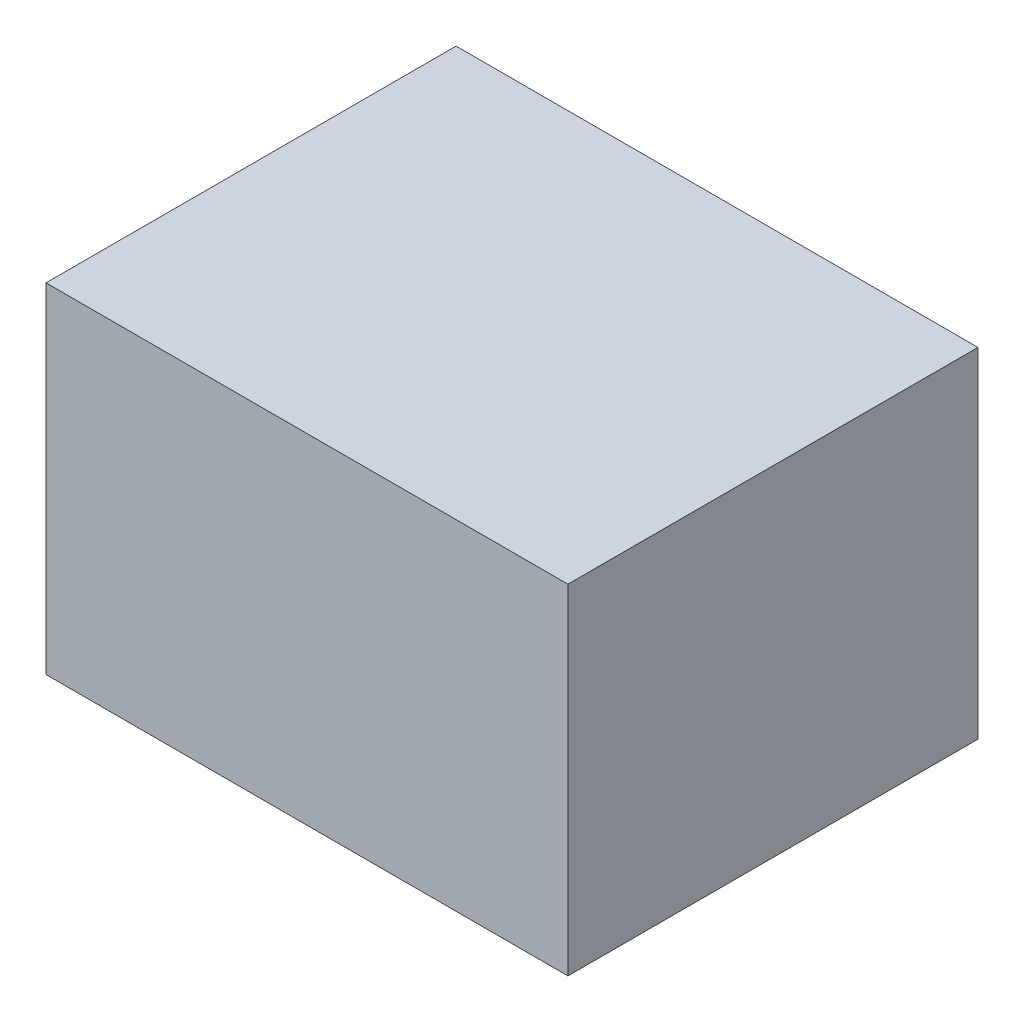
ISO-10303-21;
HEADER;
FILE_DESCRIPTION(('STEP AP214'),'2;1');
FILE_NAME('part.step','',(''),(''),'','','');
FILE_SCHEMA(('AUTOMOTIVE_DESIGN { 1 0 10303 214 1 1 1 1 }'));
ENDSEC;
DATA;
#1=APPLICATION_CONTEXT('core data for automotive mechanical design processes');
#2=APPLICATION_PROTOCOL_DEFINITION('international standard','automotive_design',2000,#1);
#3=PRODUCT_CONTEXT('',#1,'mechanical');
#4=PRODUCT('Part','Part','',(#3));
#5=PRODUCT_RELATED_PRODUCT_CATEGORY('part','',(#4));
#6=PRODUCT_DEFINITION_FORMATION('','',#4);
#7=PRODUCT_DEFINITION_CONTEXT('part definition',#1,'design');
#8=PRODUCT_DEFINITION('design','',#6,#7);
#9=PRODUCT_DEFINITION_SHAPE('','',#8);
#10=(LENGTH_UNIT() NAMED_UNIT(*) SI_UNIT(.MILLI.,.METRE.));
#11=(NAMED_UNIT(*) PLANE_ANGLE_UNIT() SI_UNIT($,.RADIAN.));
#12=(NAMED_UNIT(*) SI_UNIT($,.STERADIAN.) SOLID_ANGLE_UNIT());
#13=UNCERTAINTY_MEASURE_WITH_UNIT(LENGTH_MEASURE(1.E-05),#10,'distance_accuracy_value','');
#14=(GEOMETRIC_REPRESENTATION_CONTEXT(3) GLOBAL_UNCERTAINTY_ASSIGNED_CONTEXT((#13)) GLOBAL_UNIT_ASSIGNED_CONTEXT((#10,
#11,#12)) REPRESENTATION_CONTEXT('',''));
#15=CARTESIAN_POINT('',(0.,0.,0.));
#16=DIRECTION('',(0.,0.,1.));
#17=DIRECTION('',(1.,0.,0.));
#18=AXIS2_PLACEMENT_3D('',#15,#16,#17);
#19=CARTESIAN_POINT('',(0.,1.270000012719E-06,0.5499989));
#20=DIRECTION('',(0.,0.,-1.));
#21=DIRECTION('',(0.,-1.,0.));
#22=AXIS2_PLACEMENT_3D('',#19,#20,#21);
#23=PLANE('',#22);
#24=DIRECTION('',(-1.,0.,0.));
#25=VECTOR('',#24,1.);
#26=CARTESIAN_POINT('',(0.3499993,-0.22749764,0.5499989));
#27=LINE('',#26,#25);
#28=CARTESIAN_POINT('',(0.3499993,-0.22749764,0.5499989));
#29=VERTEX_POINT('',#28);
#30=CARTESIAN_POINT('',(-0.3499993,-0.22749764,0.5499989));
#31=VERTEX_POINT('',#30);
#32=EDGE_CURVE('E27',#29,#31,#27,.T.);
#33=ORIENTED_EDGE('',*,*,#32,.F.);
#34=DIRECTION('',(0.,-1.,0.));
#35=VECTOR('',#34,1.);
#36=CARTESIAN_POINT('',(0.3499993,0.22750018,0.5499989));
#37=LINE('',#36,#35);
#38=CARTESIAN_POINT('',(0.3499993,0.22750018,0.5499989));
#39=VERTEX_POINT('',#38);
#40=EDGE_CURVE('E73',#39,#29,#37,.T.);
#41=ORIENTED_EDGE('',*,*,#40,.F.);
#42=DIRECTION('',(1.,0.,0.));
#43=VECTOR('',#42,1.);
#44=CARTESIAN_POINT('',(-0.3499993,0.22750018,0.5499989));
#45=LINE('',#44,#43);
#46=CARTESIAN_POINT('',(-0.3499993,0.22750018,0.5499989));
#47=VERTEX_POINT('',#46);
#48=EDGE_CURVE('E77',#47,#39,#45,.T.);
#49=ORIENTED_EDGE('',*,*,#48,.F.);
#50=DIRECTION('',(0.,1.,0.));
#51=VECTOR('',#50,1.);
#52=CARTESIAN_POINT('',(-0.3499993,-0.22749764,0.5499989));
#53=LINE('',#52,#51);
#54=EDGE_CURVE('E92',#31,#47,#53,.T.);
#55=ORIENTED_EDGE('',*,*,#54,.F.);
#56=EDGE_LOOP('',(#33,#41,#49,#55));
#57=FACE_BOUND('',#56,.T.);
#58=ADVANCED_FACE('F17',(#57),#23,.F.);
#59=CARTESIAN_POINT('',(0.,1.270000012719E-06,0.));
#60=DIRECTION('',(0.,0.,-1.));
#61=DIRECTION('',(0.,-1.,0.));
#62=AXIS2_PLACEMENT_3D('',#59,#60,#61);
#63=PLANE('',#62);
#64=DIRECTION('',(0.,1.,0.));
#65=VECTOR('',#64,1.);
#66=CARTESIAN_POINT('',(-0.3499993,-0.22749764,0.));
#67=LINE('',#66,#65);
#68=CARTESIAN_POINT('',(-0.3499993,-0.22749764,0.));
#69=VERTEX_POINT('',#68);
#70=CARTESIAN_POINT('',(-0.3499993,0.22750018,0.));
#71=VERTEX_POINT('',#70);
#72=EDGE_CURVE('E68',#69,#71,#67,.T.);
#73=ORIENTED_EDGE('',*,*,#72,.T.);
#74=DIRECTION('',(1.,0.,0.));
#75=VECTOR('',#74,1.);
#76=CARTESIAN_POINT('',(-0.3499993,0.22750018,0.));
#77=LINE('',#76,#75);
#78=CARTESIAN_POINT('',(0.3499993,0.22750018,0.));
#79=VERTEX_POINT('',#78);
#80=EDGE_CURVE('E65',#71,#79,#77,.T.);
#81=ORIENTED_EDGE('',*,*,#80,.T.);
#82=DIRECTION('',(0.,-1.,0.));
#83=VECTOR('',#82,1.);
#84=CARTESIAN_POINT('',(0.3499993,0.22750018,0.));
#85=LINE('',#84,#83);
#86=CARTESIAN_POINT('',(0.3499993,-0.22749764,0.));
#87=VERTEX_POINT('',#86);
#88=EDGE_CURVE('E20',#79,#87,#85,.T.);
#89=ORIENTED_EDGE('',*,*,#88,.T.);
#90=DIRECTION('',(-1.,0.,0.));
#91=VECTOR('',#90,1.);
#92=CARTESIAN_POINT('',(0.3499993,-0.22749764,0.));
#93=LINE('',#92,#91);
#94=EDGE_CURVE('E11',#87,#69,#93,.T.);
#95=ORIENTED_EDGE('',*,*,#94,.T.);
#96=EDGE_LOOP('',(#73,#81,#89,#95));
#97=FACE_BOUND('',#96,.T.);
#98=ADVANCED_FACE('F66',(#97),#63,.T.);
#99=CARTESIAN_POINT('',(0.3499993,-0.22749764,0.));
#100=DIRECTION('',(0.,-1.,0.));
#101=DIRECTION('',(0.,0.,-1.));
#102=AXIS2_PLACEMENT_3D('',#99,#100,#101);
#103=PLANE('',#102);
#104=DIRECTION('',(0.,0.,1.));
#105=VECTOR('',#104,1.);
#106=CARTESIAN_POINT('',(0.3499993,-0.22749764,0.));
#107=LINE('',#106,#105);
#108=EDGE_CURVE('E60',#87,#29,#107,.T.);
#109=ORIENTED_EDGE('',*,*,#108,.T.);
#110=ORIENTED_EDGE('',*,*,#32,.T.);
#111=DIRECTION('',(0.,0.,1.));
#112=VECTOR('',#111,1.);
#113=CARTESIAN_POINT('',(-0.3499993,-0.22749764,0.));
#114=LINE('',#113,#112);
#115=EDGE_CURVE('E87',#69,#31,#114,.T.);
#116=ORIENTED_EDGE('',*,*,#115,.F.);
#117=ORIENTED_EDGE('',*,*,#94,.F.);
#118=EDGE_LOOP('',(#109,#110,#116,#117));
#119=FACE_BOUND('',#118,.T.);
#120=ADVANCED_FACE('F104',(#119),#103,.T.);
#121=CARTESIAN_POINT('',(0.3499993,0.22750018,0.));
#122=DIRECTION('',(1.,0.,0.));
#123=DIRECTION('',(0.,1.,0.));
#124=AXIS2_PLACEMENT_3D('',#121,#122,#123);
#125=PLANE('',#124);
#126=DIRECTION('',(0.,0.,1.));
#127=VECTOR('',#126,1.);
#128=CARTESIAN_POINT('',(0.3499993,0.22750018,0.));
#129=LINE('',#128,#127);
#130=EDGE_CURVE('E58',#79,#39,#129,.T.);
#131=ORIENTED_EDGE('',*,*,#130,.T.);
#132=ORIENTED_EDGE('',*,*,#40,.T.);
#133=ORIENTED_EDGE('',*,*,#108,.F.);
#134=ORIENTED_EDGE('',*,*,#88,.F.);
#135=EDGE_LOOP('',(#131,#132,#133,#134));
#136=FACE_BOUND('',#135,.T.);
#137=ADVANCED_FACE('F55',(#136),#125,.T.);
#138=CARTESIAN_POINT('',(-0.3499993,0.22750018,0.));
#139=DIRECTION('',(0.,1.,0.));
#140=DIRECTION('',(1.,0.,0.));
#141=AXIS2_PLACEMENT_3D('',#138,#139,#140);
#142=PLANE('',#141);
#143=DIRECTION('',(0.,0.,1.));
#144=VECTOR('',#143,1.);
#145=CARTESIAN_POINT('',(-0.3499993,0.22750018,0.));
#146=LINE('',#145,#144);
#147=EDGE_CURVE('E89',#71,#47,#146,.T.);
#148=ORIENTED_EDGE('',*,*,#147,.T.);
#149=ORIENTED_EDGE('',*,*,#48,.T.);
#150=ORIENTED_EDGE('',*,*,#130,.F.);
#151=ORIENTED_EDGE('',*,*,#80,.F.);
#152=EDGE_LOOP('',(#148,#149,#150,#151));
#153=FACE_BOUND('',#152,.T.);
#154=ADVANCED_FACE('F75',(#153),#142,.T.);
#155=CARTESIAN_POINT('',(-0.3499993,-0.22749764,0.));
#156=DIRECTION('',(-1.,0.,0.));
#157=DIRECTION('',(0.,0.,1.));
#158=AXIS2_PLACEMENT_3D('',#155,#156,#157);
#159=PLANE('',#158);
#160=ORIENTED_EDGE('',*,*,#115,.T.);
#161=ORIENTED_EDGE('',*,*,#54,.T.);
#162=ORIENTED_EDGE('',*,*,#147,.F.);
#163=ORIENTED_EDGE('',*,*,#72,.F.);
#164=EDGE_LOOP('',(#160,#161,#162,#163));
#165=FACE_BOUND('',#164,.T.);
#166=ADVANCED_FACE('F114',(#165),#159,.T.);
#167=CLOSED_SHELL('',(#58,#98,#120,#137,#154,#166));
#168=MANIFOLD_SOLID_BREP('B1',#167);
#169=ADVANCED_BREP_SHAPE_REPRESENTATION('',(#18,#168),#14);
#170=SHAPE_DEFINITION_REPRESENTATION(#9,#169);
ENDSEC;
END-ISO-10303-21;
